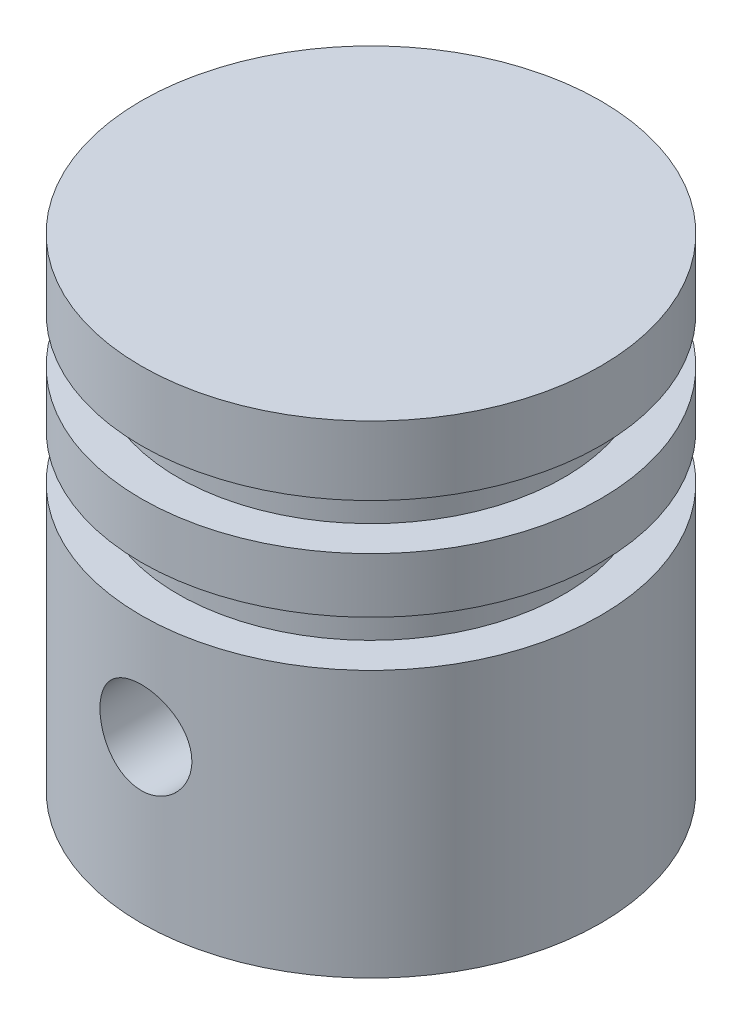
from build123d import *

# Parameters (mm, degrees)
DODANIE_WYCI_GNI_CIE1_REACH                  = 128.59
DODANIE_WYCI_GNI_CIE1_END_RADIUS             = 35
SZKIC2_R                                     = 15
SZKIC2_R_2                                   = 10
DODANIE_WYCI_GNI_CIE1_DIRECTION_2_REACH      = 128.59
DODANIE_WYCI_GNI_CIE1_DIRECTION_2_END_RADIUS = 35
WYTNIJ_WYCI_GNI_CIE1_DEPTH                   = 127.589889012
WYTNIJ_WYCI_GNI_CIE1_DEPTH_BACK              = 127.589889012
SZKIC2_2_R                                   = 10
SZKIC2_3_R                                   = 15
WYTNIJ_WYCI_GNI_CIE2_DEPTH                   = 10


with BuildPart() as part:
    # Szkic1 → Obr_t1 (revolve)
    with BuildSketch(Plane.XY, mode=Mode.PRIVATE) as obr_t1_sk:
        Polygon((0, 95), (0, 105), (50, 105), (50, 90), (42, 90), (42, 80), (50, 80), (50, 68), (42, 68), (42, 58), (50, 58), (50, 0), (35, 0), (35, 60), (14.792740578, 95), align=None)
    revolve(obr_t1_sk.sketch.rotate(Axis((0, 0, 0), (0, 1, 0)), 90), axis=Axis((0, 0, 0), (0, 1, 0)))

    # Dodanie-wyci_gni_cie1: up to this cylinder (the profile starts inside it)
    dodanie_wyci_gni_cie1_end = Plane(origin=(0, 35, 0), z_dir=(0, -1, 0)) * Cylinder(DODANIE_WYCI_GNI_CIE1_END_RADIUS, 328.18, mode=Mode.PRIVATE)
    # Szkic2 → Dodanie-wyci_gni_cie1 (add, up to the surface)
    with BuildSketch(Plane.XY, mode=Mode.PRIVATE) as dodanie_wyci_gni_cie1_sk1:
        with Locations((0, 35)):
            Circle(SZKIC2_R)
        with Locations((0, 35)):
            Circle(SZKIC2_R_2, mode=Mode.SUBTRACT)
    dodanie_wyci_gni_cie1_tool1 = extrude(dodanie_wyci_gni_cie1_sk1.sketch, amount=DODANIE_WYCI_GNI_CIE1_REACH, mode=Mode.PRIVATE) & dodanie_wyci_gni_cie1_end
    add(dodanie_wyci_gni_cie1_tool1.solids().sort_by_distance((-14.575736, 35, 0))[0])

    # Dodanie-wyci_gni_cie1 direction 2: up to this cylinder (the profile starts inside it)
    dodanie_wyci_gni_cie1_direction_2_end = Plane(origin=(0, 35, 0), z_dir=(0, -1, 0)) * Cylinder(DODANIE_WYCI_GNI_CIE1_DIRECTION_2_END_RADIUS, 328.18, mode=Mode.PRIVATE)
    # Szkic2 → Dodanie-wyci_gni_cie1 direction 2 (add, up to the surface)
    with BuildSketch(Plane.XY, mode=Mode.PRIVATE) as dodanie_wyci_gni_cie1_direction_2_sk1:
        with Locations((0, 35)):
            Circle(SZKIC2_R)
        with Locations((0, 35)):
            Circle(SZKIC2_R_2, mode=Mode.SUBTRACT)
    dodanie_wyci_gni_cie1_direction_2_tool1 = extrude(dodanie_wyci_gni_cie1_direction_2_sk1.sketch, amount=-DODANIE_WYCI_GNI_CIE1_DIRECTION_2_REACH, mode=Mode.PRIVATE) & dodanie_wyci_gni_cie1_direction_2_end
    add(dodanie_wyci_gni_cie1_direction_2_tool1.solids().sort_by_distance((-14.575736, 35, 0))[0])

    # Szkic2_2 → Wytnij-wyci_gni_cie1 (cut, two sides: drawn at the far end of the back side and taken through both)
    with BuildSketch(Plane.XY.offset(-WYTNIJ_WYCI_GNI_CIE1_DEPTH_BACK)):
        with Locations((0, 35)):
            Circle(SZKIC2_2_R)
    extrude(amount=WYTNIJ_WYCI_GNI_CIE1_DEPTH + WYTNIJ_WYCI_GNI_CIE1_DEPTH_BACK, mode=Mode.SUBTRACT)

    # Szkic2_3 → Wytnij-wyci_gni_cie2 (cut, symmetric)
    with BuildSketch(Plane.XY):
        with Locations((0, 35)):
            Circle(SZKIC2_3_R)
    extrude(amount=WYTNIJ_WYCI_GNI_CIE2_DEPTH, both=True, mode=Mode.SUBTRACT)


solid = part.part
